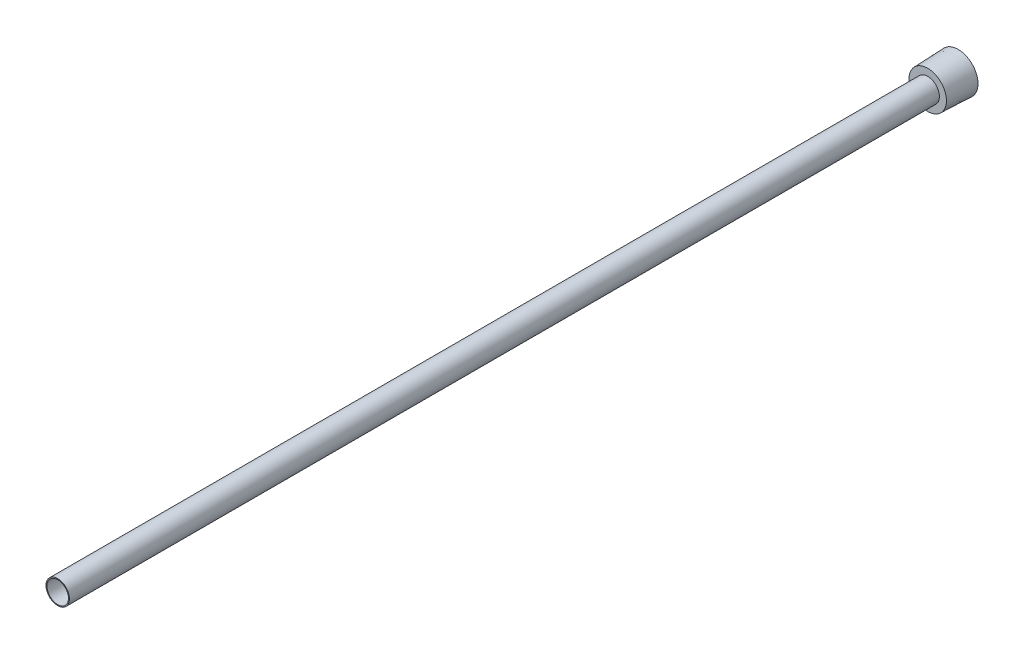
from build123d import *

# Parameters (mm, degrees)
SKETCH2_R          = 3.65125
CUT_EXTRUDE1_DEPTH = 305.948046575
CUT_EXTRUDE2_DEPTH = 6.35


with BuildPart() as part:
    # Sketch1 → Revolve1 (revolve)
    with BuildSketch(Plane(origin=(0, 0, 0), x_dir=(0, 0, -1), z_dir=(1, 0, 0)), mode=Mode.PRIVATE) as revolve1_sk:
        Polygon((0, 0), (-304.8, 0), (-304.8, 3.96875), (-10.3124, 3.96875), (-10.3124, 6.342143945), (0, 6.7183), align=None)
    revolve(revolve1_sk.sketch.rotate(Axis((0, 0, 331.124179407), (0, 0, -1)), 90), axis=Axis((0, 0, 331.124179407), (0, 0, -1)))

    # Sketch2 → Cut-Extrude1 (cut, through all)
    with BuildSketch(Plane.XY.offset(304.8)):
        Circle(SKETCH2_R)
    extrude(amount=-CUT_EXTRUDE1_DEPTH, mode=Mode.SUBTRACT)

    # Sketch3 → Cut-Extrude2 (cut)
    with BuildSketch(Plane(origin=(0, 0, 0), x_dir=(-1, 0, 0), z_dir=(0, 0, -1))):
        Polygon((-4.7625, -2.749630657), (0, -5.499261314), (4.7625, -2.749630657), (4.7625, 2.749630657), (0, 5.499261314), (-4.7625, 2.749630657), align=None)
    extrude(amount=-CUT_EXTRUDE2_DEPTH, mode=Mode.SUBTRACT)


solid = part.part
